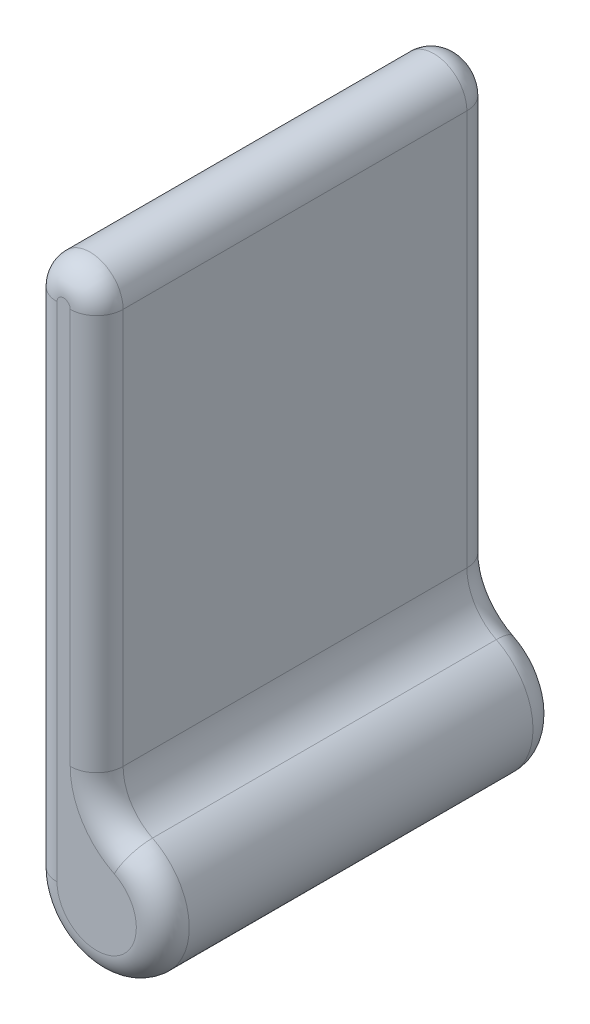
from build123d import *

# Parameters (mm, degrees)
BOSS_EXTRUDE1_DEPTH = 3.81
FILLET1_R           = 0.254


with BuildPart() as part:
    # Sketch1 → Boss-Extrude1 (new body)
    with BuildSketch(Plane.XY):
        with BuildLine():
            Line((-0.3175, 0), (-0.3175, -4.826))
            ThreePointArc((-0.3175, -4.826), (0.652174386, -5.365646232), (0.599722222, -4.257162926))
            ThreePointArc((0.599722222, -4.257162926), (0.393783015, -4.069832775), (0.3175, -3.802093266))
            Line((0.3175, -3.802093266), (0.3175, 0))
            ThreePointArc((0.3175, 0), (0, 0.3175), (-0.3175, 0))
        make_face()
    extrude(amount=BOSS_EXTRUDE1_DEPTH)

    # Fillet1
    fillet1_edges = [part.edges().sort_by_distance(p)[0] for p in [
        (0, 0.3175, 3.81),
        (-0.3175, -2.413, 3.81),
        (0.652174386, -5.365646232, 3.81),
        (0.393783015, -4.069832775, 3.81),
        (0.652174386, -5.365646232, 0),
        (-0.3175, -2.413, 0),
        (0, 0.3175, 0),
        (0.3175, -1.901046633, 0),
        (0.393783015, -4.069832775, 0),
        (0.3175, -1.901046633, 3.81),
    ]]
    fillet(fillet1_edges, radius=FILLET1_R)


solid = part.part
